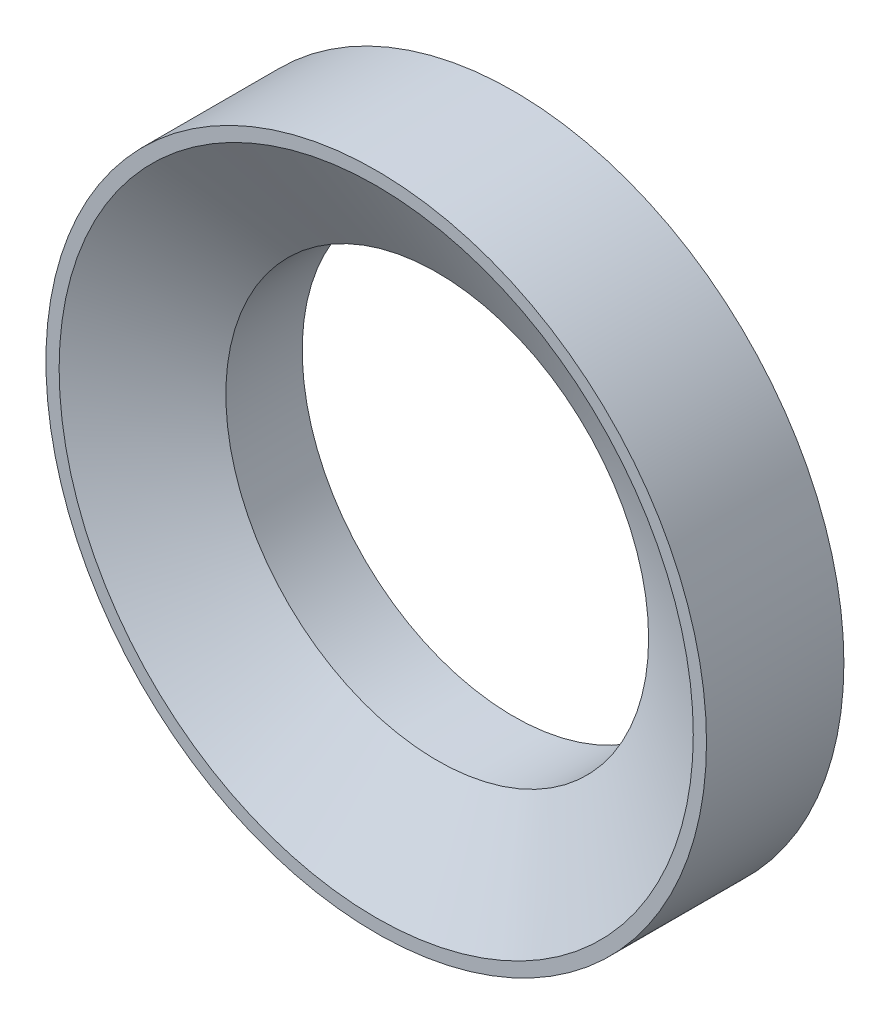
ISO-10303-21;
HEADER;
FILE_DESCRIPTION(('STEP AP214'),'2;1');
FILE_NAME('part.step','',(''),(''),'','','');
FILE_SCHEMA(('AUTOMOTIVE_DESIGN { 1 0 10303 214 1 1 1 1 }'));
ENDSEC;
DATA;
#1=APPLICATION_CONTEXT('core data for automotive mechanical design processes');
#2=APPLICATION_PROTOCOL_DEFINITION('international standard','automotive_design',2000,#1);
#3=PRODUCT_CONTEXT('',#1,'mechanical');
#4=PRODUCT('Part','Part','',(#3));
#5=PRODUCT_RELATED_PRODUCT_CATEGORY('part','',(#4));
#6=PRODUCT_DEFINITION_FORMATION('','',#4);
#7=PRODUCT_DEFINITION_CONTEXT('part definition',#1,'design');
#8=PRODUCT_DEFINITION('design','',#6,#7);
#9=PRODUCT_DEFINITION_SHAPE('','',#8);
#10=(LENGTH_UNIT() NAMED_UNIT(*) SI_UNIT(.MILLI.,.METRE.));
#11=(NAMED_UNIT(*) PLANE_ANGLE_UNIT() SI_UNIT($,.RADIAN.));
#12=(NAMED_UNIT(*) SI_UNIT($,.STERADIAN.) SOLID_ANGLE_UNIT());
#13=UNCERTAINTY_MEASURE_WITH_UNIT(LENGTH_MEASURE(1.E-05),#10,'distance_accuracy_value','');
#14=(GEOMETRIC_REPRESENTATION_CONTEXT(3) GLOBAL_UNCERTAINTY_ASSIGNED_CONTEXT((#13)) GLOBAL_UNIT_ASSIGNED_CONTEXT((#10,
#11,#12)) REPRESENTATION_CONTEXT('',''));
#15=CARTESIAN_POINT('',(0.,0.,0.));
#16=DIRECTION('',(0.,0.,1.));
#17=DIRECTION('',(1.,0.,0.));
#18=AXIS2_PLACEMENT_3D('',#15,#16,#17);
#19=CARTESIAN_POINT('',(0.,0.,-1.15470053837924));
#20=DIRECTION('',(0.,0.,1.));
#21=DIRECTION('',(1.,0.,0.));
#22=AXIS2_PLACEMENT_3D('',#19,#20,#21);
#23=CONICAL_SURFACE('',#22,4.,1.0471975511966);
#24=CARTESIAN_POINT('',(0.,0.,0.));
#25=DIRECTION('',(0.,0.,1.));
#26=DIRECTION('',(1.,0.,0.));
#27=AXIS2_PLACEMENT_3D('',#24,#25,#26);
#28=CIRCLE('',#27,6.);
#29=CARTESIAN_POINT('',(6.,0.,0.));
#30=VERTEX_POINT('',#29);
#31=EDGE_CURVE('E10',#30,#30,#28,.T.);
#32=ORIENTED_EDGE('',*,*,#31,.T.);
#33=EDGE_LOOP('',(#32));
#34=FACE_BOUND('',#33,.T.);
#35=CARTESIAN_POINT('',(0.,0.,-1.15470053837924));
#36=DIRECTION('',(0.,0.,1.));
#37=DIRECTION('',(1.,0.,0.));
#38=AXIS2_PLACEMENT_3D('',#35,#36,#37);
#39=CIRCLE('',#38,4.);
#40=CARTESIAN_POINT('',(4.,0.,-1.15470053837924));
#41=VERTEX_POINT('',#40);
#42=EDGE_CURVE('E56',#41,#41,#39,.T.);
#43=ORIENTED_EDGE('',*,*,#42,.F.);
#44=EDGE_LOOP('',(#43));
#45=FACE_BOUND('',#44,.T.);
#46=ADVANCED_FACE('F37',(#34,#45),#23,.F.);
#47=CARTESIAN_POINT('',(0.,6.25,0.));
#48=DIRECTION('',(0.,0.,1.));
#49=DIRECTION('',(1.,0.,0.));
#50=AXIS2_PLACEMENT_3D('',#47,#48,#49);
#51=PLANE('',#50);
#52=CARTESIAN_POINT('',(0.,0.,0.));
#53=DIRECTION('',(0.,0.,1.));
#54=DIRECTION('',(1.,0.,0.));
#55=AXIS2_PLACEMENT_3D('',#52,#53,#54);
#56=CIRCLE('',#55,6.25);
#57=CARTESIAN_POINT('',(6.25,0.,0.));
#58=VERTEX_POINT('',#57);
#59=EDGE_CURVE('E43',#58,#58,#56,.T.);
#60=ORIENTED_EDGE('',*,*,#59,.T.);
#61=EDGE_LOOP('',(#60));
#62=FACE_BOUND('',#61,.T.);
#63=ORIENTED_EDGE('',*,*,#31,.F.);
#64=EDGE_LOOP('',(#63));
#65=FACE_BOUND('',#64,.T.);
#66=ADVANCED_FACE('F64',(#62,#65),#51,.T.);
#67=CARTESIAN_POINT('',(0.,0.,12.9484938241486));
#68=DIRECTION('',(0.,0.,1.));
#69=DIRECTION('',(1.,0.,0.));
#70=AXIS2_PLACEMENT_3D('',#67,#68,#69);
#71=CYLINDRICAL_SURFACE('',#70,6.25);
#72=CARTESIAN_POINT('',(0.,0.,-2.6));
#73=DIRECTION('',(0.,0.,1.));
#74=DIRECTION('',(1.,0.,0.));
#75=AXIS2_PLACEMENT_3D('',#72,#73,#74);
#76=CIRCLE('',#75,6.25);
#77=CARTESIAN_POINT('',(6.25,0.,-2.6));
#78=VERTEX_POINT('',#77);
#79=EDGE_CURVE('E47',#78,#78,#76,.T.);
#80=ORIENTED_EDGE('',*,*,#79,.T.);
#81=EDGE_LOOP('',(#80));
#82=FACE_BOUND('',#81,.T.);
#83=ORIENTED_EDGE('',*,*,#59,.F.);
#84=EDGE_LOOP('',(#83));
#85=FACE_BOUND('',#84,.T.);
#86=ADVANCED_FACE('F68',(#82,#85),#71,.T.);
#87=CARTESIAN_POINT('',(0.,4.,-2.6));
#88=DIRECTION('',(0.,0.,-1.));
#89=DIRECTION('',(-1.,0.,0.));
#90=AXIS2_PLACEMENT_3D('',#87,#88,#89);
#91=PLANE('',#90);
#92=CARTESIAN_POINT('',(0.,0.,-2.6));
#93=DIRECTION('',(0.,0.,1.));
#94=DIRECTION('',(1.,0.,0.));
#95=AXIS2_PLACEMENT_3D('',#92,#93,#94);
#96=CIRCLE('',#95,4.);
#97=CARTESIAN_POINT('',(4.,0.,-2.6));
#98=VERTEX_POINT('',#97);
#99=EDGE_CURVE('E51',#98,#98,#96,.T.);
#100=ORIENTED_EDGE('',*,*,#99,.T.);
#101=EDGE_LOOP('',(#100));
#102=FACE_BOUND('',#101,.T.);
#103=ORIENTED_EDGE('',*,*,#79,.F.);
#104=EDGE_LOOP('',(#103));
#105=FACE_BOUND('',#104,.T.);
#106=ADVANCED_FACE('F72',(#102,#105),#91,.T.);
#107=CARTESIAN_POINT('',(0.,0.,12.9484938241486));
#108=DIRECTION('',(0.,0.,1.));
#109=DIRECTION('',(1.,0.,0.));
#110=AXIS2_PLACEMENT_3D('',#107,#108,#109);
#111=CYLINDRICAL_SURFACE('',#110,4.);
#112=ORIENTED_EDGE('',*,*,#42,.T.);
#113=EDGE_LOOP('',(#112));
#114=FACE_BOUND('',#113,.T.);
#115=ORIENTED_EDGE('',*,*,#99,.F.);
#116=EDGE_LOOP('',(#115));
#117=FACE_BOUND('',#116,.T.);
#118=ADVANCED_FACE('F60',(#114,#117),#111,.F.);
#119=CLOSED_SHELL('',(#46,#66,#86,#106,#118));
#120=MANIFOLD_SOLID_BREP('B2',#119);
#121=ADVANCED_BREP_SHAPE_REPRESENTATION('',(#18,#120),#14);
#122=SHAPE_DEFINITION_REPRESENTATION(#9,#121);
ENDSEC;
END-ISO-10303-21;
